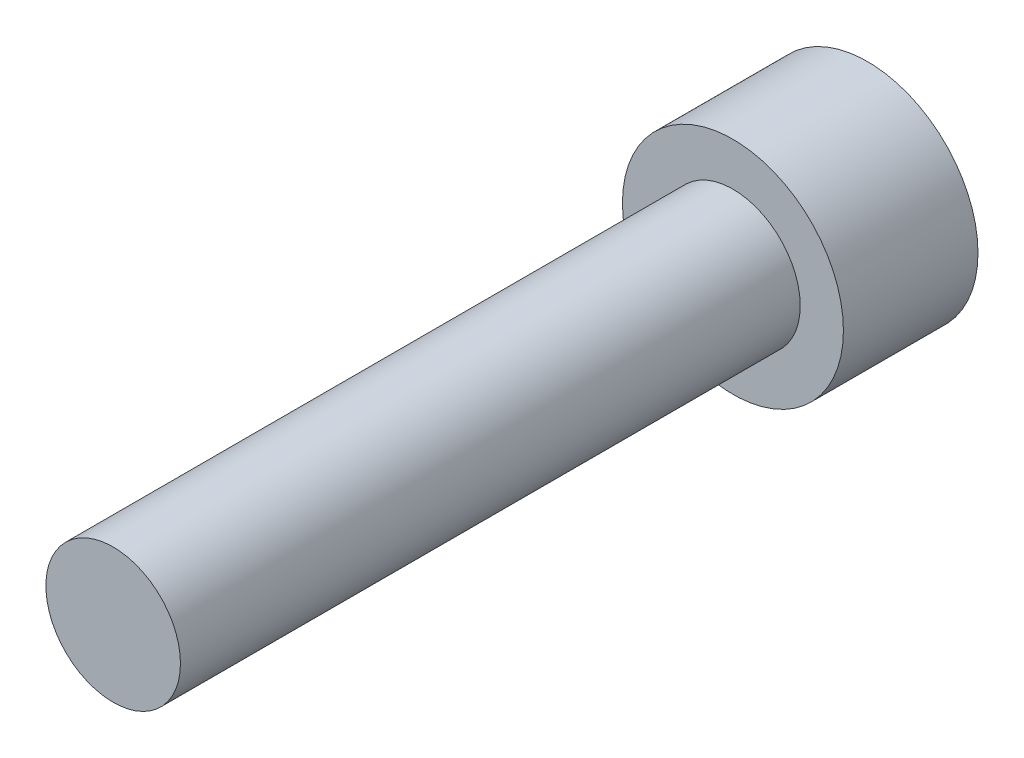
ISO-10303-21;
HEADER;
FILE_DESCRIPTION(('STEP AP214'),'2;1');
FILE_NAME('part.step','',(''),(''),'','','');
FILE_SCHEMA(('AUTOMOTIVE_DESIGN { 1 0 10303 214 1 1 1 1 }'));
ENDSEC;
DATA;
#1=APPLICATION_CONTEXT('core data for automotive mechanical design processes');
#2=APPLICATION_PROTOCOL_DEFINITION('international standard','automotive_design',2000,#1);
#3=PRODUCT_CONTEXT('',#1,'mechanical');
#4=PRODUCT('Part','Part','',(#3));
#5=PRODUCT_RELATED_PRODUCT_CATEGORY('part','',(#4));
#6=PRODUCT_DEFINITION_FORMATION('','',#4);
#7=PRODUCT_DEFINITION_CONTEXT('part definition',#1,'design');
#8=PRODUCT_DEFINITION('design','',#6,#7);
#9=PRODUCT_DEFINITION_SHAPE('','',#8);
#10=(LENGTH_UNIT() NAMED_UNIT(*) SI_UNIT(.MILLI.,.METRE.));
#11=(NAMED_UNIT(*) PLANE_ANGLE_UNIT() SI_UNIT($,.RADIAN.));
#12=(NAMED_UNIT(*) SI_UNIT($,.STERADIAN.) SOLID_ANGLE_UNIT());
#13=UNCERTAINTY_MEASURE_WITH_UNIT(LENGTH_MEASURE(1.E-05),#10,'distance_accuracy_value','');
#14=(GEOMETRIC_REPRESENTATION_CONTEXT(3) GLOBAL_UNCERTAINTY_ASSIGNED_CONTEXT((#13)) GLOBAL_UNIT_ASSIGNED_CONTEXT((#10,
#11,#12)) REPRESENTATION_CONTEXT('',''));
#15=CARTESIAN_POINT('',(0.,0.,0.));
#16=DIRECTION('',(0.,0.,1.));
#17=DIRECTION('',(1.,0.,0.));
#18=AXIS2_PLACEMENT_3D('',#15,#16,#17);
#19=CARTESIAN_POINT('',(0.,0.,22.225));
#20=DIRECTION('',(0.,0.,1.));
#21=DIRECTION('',(1.,0.,0.));
#22=AXIS2_PLACEMENT_3D('',#19,#20,#21);
#23=PLANE('',#22);
#24=CARTESIAN_POINT('',(0.,0.,22.225));
#25=DIRECTION('',(0.,0.,1.));
#26=DIRECTION('',(1.,0.,0.));
#27=AXIS2_PLACEMENT_3D('',#24,#25,#26);
#28=CIRCLE('',#27,2.413);
#29=CARTESIAN_POINT('',(2.413,0.,22.225));
#30=VERTEX_POINT('',#29);
#31=EDGE_CURVE('E11',#30,#30,#28,.T.);
#32=ORIENTED_EDGE('',*,*,#31,.T.);
#33=EDGE_LOOP('',(#32));
#34=FACE_BOUND('',#33,.T.);
#35=ADVANCED_FACE('F37',(#34),#23,.T.);
#36=CARTESIAN_POINT('',(0.,0.,22.225));
#37=DIRECTION('',(0.,0.,1.));
#38=DIRECTION('',(1.,0.,0.));
#39=AXIS2_PLACEMENT_3D('',#36,#37,#38);
#40=CYLINDRICAL_SURFACE('',#39,2.413);
#41=CARTESIAN_POINT('',(0.,0.,0.));
#42=DIRECTION('',(0.,0.,1.));
#43=DIRECTION('',(1.,0.,0.));
#44=AXIS2_PLACEMENT_3D('',#41,#42,#43);
#45=CIRCLE('',#44,2.413);
#46=CARTESIAN_POINT('',(2.413,0.,0.));
#47=VERTEX_POINT('',#46);
#48=EDGE_CURVE('E44',#47,#47,#45,.T.);
#49=ORIENTED_EDGE('',*,*,#48,.T.);
#50=EDGE_LOOP('',(#49));
#51=FACE_BOUND('',#50,.T.);
#52=ORIENTED_EDGE('',*,*,#31,.F.);
#53=EDGE_LOOP('',(#52));
#54=FACE_BOUND('',#53,.T.);
#55=ADVANCED_FACE('F151',(#51,#54),#40,.T.);
#56=CARTESIAN_POINT('',(0.,-2.413,0.));
#57=DIRECTION('',(0.,0.,1.));
#58=DIRECTION('',(1.,0.,0.));
#59=AXIS2_PLACEMENT_3D('',#56,#57,#58);
#60=PLANE('',#59);
#61=CARTESIAN_POINT('',(0.,0.,0.));
#62=DIRECTION('',(0.,0.,1.));
#63=DIRECTION('',(1.,0.,0.));
#64=AXIS2_PLACEMENT_3D('',#61,#62,#63);
#65=CIRCLE('',#64,3.9624);
#66=CARTESIAN_POINT('',(3.9624,0.,0.));
#67=VERTEX_POINT('',#66);
#68=EDGE_CURVE('E146',#67,#67,#65,.T.);
#69=ORIENTED_EDGE('',*,*,#68,.T.);
#70=EDGE_LOOP('',(#69));
#71=FACE_BOUND('',#70,.T.);
#72=ORIENTED_EDGE('',*,*,#48,.F.);
#73=EDGE_LOOP('',(#72));
#74=FACE_BOUND('',#73,.T.);
#75=ADVANCED_FACE('F154',(#71,#74),#60,.T.);
#76=CARTESIAN_POINT('',(0.,0.,22.225));
#77=DIRECTION('',(0.,0.,1.));
#78=DIRECTION('',(1.,0.,0.));
#79=AXIS2_PLACEMENT_3D('',#76,#77,#78);
#80=CYLINDRICAL_SURFACE('',#79,3.9624);
#81=CARTESIAN_POINT('',(0.,0.,-4.826));
#82=DIRECTION('',(0.,0.,1.));
#83=DIRECTION('',(1.,0.,0.));
#84=AXIS2_PLACEMENT_3D('',#81,#82,#83);
#85=CIRCLE('',#84,3.9624);
#86=CARTESIAN_POINT('',(3.9624,0.,-4.826));
#87=VERTEX_POINT('',#86);
#88=EDGE_CURVE('E138',#87,#87,#85,.T.);
#89=ORIENTED_EDGE('',*,*,#88,.T.);
#90=EDGE_LOOP('',(#89));
#91=FACE_BOUND('',#90,.T.);
#92=ORIENTED_EDGE('',*,*,#68,.F.);
#93=EDGE_LOOP('',(#92));
#94=FACE_BOUND('',#93,.T.);
#95=ADVANCED_FACE('F156',(#91,#94),#80,.T.);
#96=CARTESIAN_POINT('',(0.,-3.9624,-4.826));
#97=DIRECTION('',(0.,0.,-1.));
#98=DIRECTION('',(-1.,0.,0.));
#99=AXIS2_PLACEMENT_3D('',#96,#97,#98);
#100=PLANE('',#99);
#101=DIRECTION('',(0.866025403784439,-0.5,0.));
#102=VECTOR('',#101,1.);
#103=CARTESIAN_POINT('',(0.,2.28769270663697,-4.826));
#104=LINE('',#103,#102);
#105=CARTESIAN_POINT('',(0.,2.28769270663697,-4.826));
#106=VERTEX_POINT('',#105);
#107=CARTESIAN_POINT('',(1.9812,1.14384635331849,-4.826));
#108=VERTEX_POINT('',#107);
#109=EDGE_CURVE('E51',#106,#108,#104,.T.);
#110=ORIENTED_EDGE('',*,*,#109,.F.);
#111=DIRECTION('',(0.866025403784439,0.5,0.));
#112=VECTOR('',#111,1.);
#113=CARTESIAN_POINT('',(-1.9812,1.14384635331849,-4.826));
#114=LINE('',#113,#112);
#115=CARTESIAN_POINT('',(-1.9812,1.14384635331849,-4.826));
#116=VERTEX_POINT('',#115);
#117=EDGE_CURVE('E134',#116,#106,#114,.T.);
#118=ORIENTED_EDGE('',*,*,#117,.F.);
#119=DIRECTION('',(0.,1.,0.));
#120=VECTOR('',#119,1.);
#121=CARTESIAN_POINT('',(-1.9812,-1.14384635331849,-4.826));
#122=LINE('',#121,#120);
#123=CARTESIAN_POINT('',(-1.9812,-1.14384635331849,-4.826));
#124=VERTEX_POINT('',#123);
#125=EDGE_CURVE('E132',#124,#116,#122,.T.);
#126=ORIENTED_EDGE('',*,*,#125,.F.);
#127=DIRECTION('',(-0.866025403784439,0.5,0.));
#128=VECTOR('',#127,1.);
#129=CARTESIAN_POINT('',(0.,-2.28769270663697,-4.826));
#130=LINE('',#129,#128);
#131=CARTESIAN_POINT('',(0.,-2.28769270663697,-4.826));
#132=VERTEX_POINT('',#131);
#133=EDGE_CURVE('E99',#132,#124,#130,.T.);
#134=ORIENTED_EDGE('',*,*,#133,.F.);
#135=DIRECTION('',(-0.866025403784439,-0.5,0.));
#136=VECTOR('',#135,1.);
#137=CARTESIAN_POINT('',(1.9812,-1.14384635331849,-4.826));
#138=LINE('',#137,#136);
#139=CARTESIAN_POINT('',(1.9812,-1.14384635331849,-4.826));
#140=VERTEX_POINT('',#139);
#141=EDGE_CURVE('E128',#140,#132,#138,.T.);
#142=ORIENTED_EDGE('',*,*,#141,.F.);
#143=DIRECTION('',(0.,-1.,0.));
#144=VECTOR('',#143,1.);
#145=CARTESIAN_POINT('',(1.9812,1.14384635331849,-4.826));
#146=LINE('',#145,#144);
#147=EDGE_CURVE('E125',#108,#140,#146,.T.);
#148=ORIENTED_EDGE('',*,*,#147,.F.);
#149=EDGE_LOOP('',(#110,#118,#126,#134,#142,#148));
#150=FACE_BOUND('',#149,.T.);
#151=ORIENTED_EDGE('',*,*,#88,.F.);
#152=EDGE_LOOP('',(#151));
#153=FACE_BOUND('',#152,.T.);
#154=ADVANCED_FACE('F163',(#150,#153),#100,.T.);
#155=CARTESIAN_POINT('',(0.,2.28769270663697,-1.778));
#156=DIRECTION('',(0.5,0.866025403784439,0.));
#157=DIRECTION('',(-0.866025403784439,0.5,0.));
#158=AXIS2_PLACEMENT_3D('',#155,#156,#157);
#159=PLANE('',#158);
#160=ORIENTED_EDGE('',*,*,#109,.T.);
#161=DIRECTION('',(0.,0.,-1.));
#162=VECTOR('',#161,1.);
#163=CARTESIAN_POINT('',(1.9812,1.14384635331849,-1.778));
#164=LINE('',#163,#162);
#165=CARTESIAN_POINT('',(1.9812,1.14384635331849,-1.778));
#166=VERTEX_POINT('',#165);
#167=EDGE_CURVE('E81',#166,#108,#164,.T.);
#168=ORIENTED_EDGE('',*,*,#167,.F.);
#169=DIRECTION('',(0.866025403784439,-0.5,0.));
#170=VECTOR('',#169,1.);
#171=CARTESIAN_POINT('',(0.,2.28769270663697,-1.778));
#172=LINE('',#171,#170);
#173=CARTESIAN_POINT('',(0.,2.28769270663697,-1.778));
#174=VERTEX_POINT('',#173);
#175=EDGE_CURVE('E136',#174,#166,#172,.T.);
#176=ORIENTED_EDGE('',*,*,#175,.F.);
#177=DIRECTION('',(0.,0.,-1.));
#178=VECTOR('',#177,1.);
#179=CARTESIAN_POINT('',(0.,2.28769270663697,-1.778));
#180=LINE('',#179,#178);
#181=EDGE_CURVE('E59',#174,#106,#180,.T.);
#182=ORIENTED_EDGE('',*,*,#181,.T.);
#183=EDGE_LOOP('',(#160,#168,#176,#182));
#184=FACE_BOUND('',#183,.T.);
#185=ADVANCED_FACE('F197',(#184),#159,.F.);
#186=CARTESIAN_POINT('',(-1.9812,1.14384635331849,-1.778));
#187=DIRECTION('',(-0.5,0.866025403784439,0.));
#188=DIRECTION('',(-0.866025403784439,-0.5,0.));
#189=AXIS2_PLACEMENT_3D('',#186,#187,#188);
#190=PLANE('',#189);
#191=ORIENTED_EDGE('',*,*,#117,.T.);
#192=ORIENTED_EDGE('',*,*,#181,.F.);
#193=DIRECTION('',(0.866025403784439,0.5,0.));
#194=VECTOR('',#193,1.);
#195=CARTESIAN_POINT('',(-1.9812,1.14384635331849,-1.778));
#196=LINE('',#195,#194);
#197=CARTESIAN_POINT('',(-1.9812,1.14384635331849,-1.778));
#198=VERTEX_POINT('',#197);
#199=EDGE_CURVE('E111',#198,#174,#196,.T.);
#200=ORIENTED_EDGE('',*,*,#199,.F.);
#201=DIRECTION('',(0.,0.,-1.));
#202=VECTOR('',#201,1.);
#203=CARTESIAN_POINT('',(-1.9812,1.14384635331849,-1.778));
#204=LINE('',#203,#202);
#205=EDGE_CURVE('E103',#198,#116,#204,.T.);
#206=ORIENTED_EDGE('',*,*,#205,.T.);
#207=EDGE_LOOP('',(#191,#192,#200,#206));
#208=FACE_BOUND('',#207,.T.);
#209=ADVANCED_FACE('F208',(#208),#190,.F.);
#210=CARTESIAN_POINT('',(-1.9812,-1.14384635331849,-1.778));
#211=DIRECTION('',(-1.,0.,0.));
#212=DIRECTION('',(0.,-1.,0.));
#213=AXIS2_PLACEMENT_3D('',#210,#211,#212);
#214=PLANE('',#213);
#215=ORIENTED_EDGE('',*,*,#125,.T.);
#216=ORIENTED_EDGE('',*,*,#205,.F.);
#217=DIRECTION('',(0.,1.,0.));
#218=VECTOR('',#217,1.);
#219=CARTESIAN_POINT('',(-1.9812,-1.14384635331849,-1.778));
#220=LINE('',#219,#218);
#221=CARTESIAN_POINT('',(-1.9812,-1.14384635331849,-1.778));
#222=VERTEX_POINT('',#221);
#223=EDGE_CURVE('E107',#222,#198,#220,.T.);
#224=ORIENTED_EDGE('',*,*,#223,.F.);
#225=DIRECTION('',(0.,0.,-1.));
#226=VECTOR('',#225,1.);
#227=CARTESIAN_POINT('',(-1.9812,-1.14384635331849,-1.778));
#228=LINE('',#227,#226);
#229=EDGE_CURVE('E92',#222,#124,#228,.T.);
#230=ORIENTED_EDGE('',*,*,#229,.T.);
#231=EDGE_LOOP('',(#215,#216,#224,#230));
#232=FACE_BOUND('',#231,.T.);
#233=ADVANCED_FACE('F108',(#232),#214,.F.);
#234=CARTESIAN_POINT('',(0.,-2.28769270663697,-1.778));
#235=DIRECTION('',(-0.5,-0.866025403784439,0.));
#236=DIRECTION('',(0.866025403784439,-0.5,0.));
#237=AXIS2_PLACEMENT_3D('',#234,#235,#236);
#238=PLANE('',#237);
#239=ORIENTED_EDGE('',*,*,#133,.T.);
#240=ORIENTED_EDGE('',*,*,#229,.F.);
#241=DIRECTION('',(-0.866025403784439,0.5,0.));
#242=VECTOR('',#241,1.);
#243=CARTESIAN_POINT('',(0.,-2.28769270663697,-1.778));
#244=LINE('',#243,#242);
#245=CARTESIAN_POINT('',(0.,-2.28769270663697,-1.778));
#246=VERTEX_POINT('',#245);
#247=EDGE_CURVE('E96',#246,#222,#244,.T.);
#248=ORIENTED_EDGE('',*,*,#247,.F.);
#249=DIRECTION('',(0.,0.,-1.));
#250=VECTOR('',#249,1.);
#251=CARTESIAN_POINT('',(0.,-2.28769270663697,-1.778));
#252=LINE('',#251,#250);
#253=EDGE_CURVE('E104',#246,#132,#252,.T.);
#254=ORIENTED_EDGE('',*,*,#253,.T.);
#255=EDGE_LOOP('',(#239,#240,#248,#254));
#256=FACE_BOUND('',#255,.T.);
#257=ADVANCED_FACE('F94',(#256),#238,.F.);
#258=CARTESIAN_POINT('',(1.9812,-1.14384635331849,-1.778));
#259=DIRECTION('',(0.5,-0.866025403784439,0.));
#260=DIRECTION('',(0.866025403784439,0.5,0.));
#261=AXIS2_PLACEMENT_3D('',#258,#259,#260);
#262=PLANE('',#261);
#263=ORIENTED_EDGE('',*,*,#141,.T.);
#264=ORIENTED_EDGE('',*,*,#253,.F.);
#265=DIRECTION('',(-0.866025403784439,-0.5,0.));
#266=VECTOR('',#265,1.);
#267=CARTESIAN_POINT('',(1.9812,-1.14384635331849,-1.778));
#268=LINE('',#267,#266);
#269=CARTESIAN_POINT('',(1.9812,-1.14384635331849,-1.778));
#270=VERTEX_POINT('',#269);
#271=EDGE_CURVE('E117',#270,#246,#268,.T.);
#272=ORIENTED_EDGE('',*,*,#271,.F.);
#273=DIRECTION('',(0.,0.,-1.));
#274=VECTOR('',#273,1.);
#275=CARTESIAN_POINT('',(1.9812,-1.14384635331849,-1.778));
#276=LINE('',#275,#274);
#277=EDGE_CURVE('E141',#270,#140,#276,.T.);
#278=ORIENTED_EDGE('',*,*,#277,.T.);
#279=EDGE_LOOP('',(#263,#264,#272,#278));
#280=FACE_BOUND('',#279,.T.);
#281=ADVANCED_FACE('F236',(#280),#262,.F.);
#282=CARTESIAN_POINT('',(1.9812,1.14384635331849,-1.778));
#283=DIRECTION('',(1.,0.,0.));
#284=DIRECTION('',(0.,0.,-1.));
#285=AXIS2_PLACEMENT_3D('',#282,#283,#284);
#286=PLANE('',#285);
#287=ORIENTED_EDGE('',*,*,#147,.T.);
#288=ORIENTED_EDGE('',*,*,#277,.F.);
#289=DIRECTION('',(0.,-1.,0.));
#290=VECTOR('',#289,1.);
#291=CARTESIAN_POINT('',(1.9812,1.14384635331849,-1.778));
#292=LINE('',#291,#290);
#293=EDGE_CURVE('E119',#166,#270,#292,.T.);
#294=ORIENTED_EDGE('',*,*,#293,.F.);
#295=ORIENTED_EDGE('',*,*,#167,.T.);
#296=EDGE_LOOP('',(#287,#288,#294,#295));
#297=FACE_BOUND('',#296,.T.);
#298=ADVANCED_FACE('F246',(#297),#286,.F.);
#299=CARTESIAN_POINT('',(3.9624,0.,-1.778));
#300=DIRECTION('',(0.,0.,-1.));
#301=DIRECTION('',(-1.,0.,0.));
#302=AXIS2_PLACEMENT_3D('',#299,#300,#301);
#303=PLANE('',#302);
#304=ORIENTED_EDGE('',*,*,#175,.T.);
#305=ORIENTED_EDGE('',*,*,#293,.T.);
#306=ORIENTED_EDGE('',*,*,#271,.T.);
#307=ORIENTED_EDGE('',*,*,#247,.T.);
#308=ORIENTED_EDGE('',*,*,#223,.T.);
#309=ORIENTED_EDGE('',*,*,#199,.T.);
#310=EDGE_LOOP('',(#304,#305,#306,#307,#308,#309));
#311=FACE_BOUND('',#310,.T.);
#312=ADVANCED_FACE('F114',(#311),#303,.T.);
#313=CLOSED_SHELL('',(#35,#55,#75,#95,#154,#185,#209,#233,#257,#281,#298,#312));
#314=MANIFOLD_SOLID_BREP('B2',#313);
#315=ADVANCED_BREP_SHAPE_REPRESENTATION('',(#18,#314),#14);
#316=SHAPE_DEFINITION_REPRESENTATION(#9,#315);
ENDSEC;
END-ISO-10303-21;
